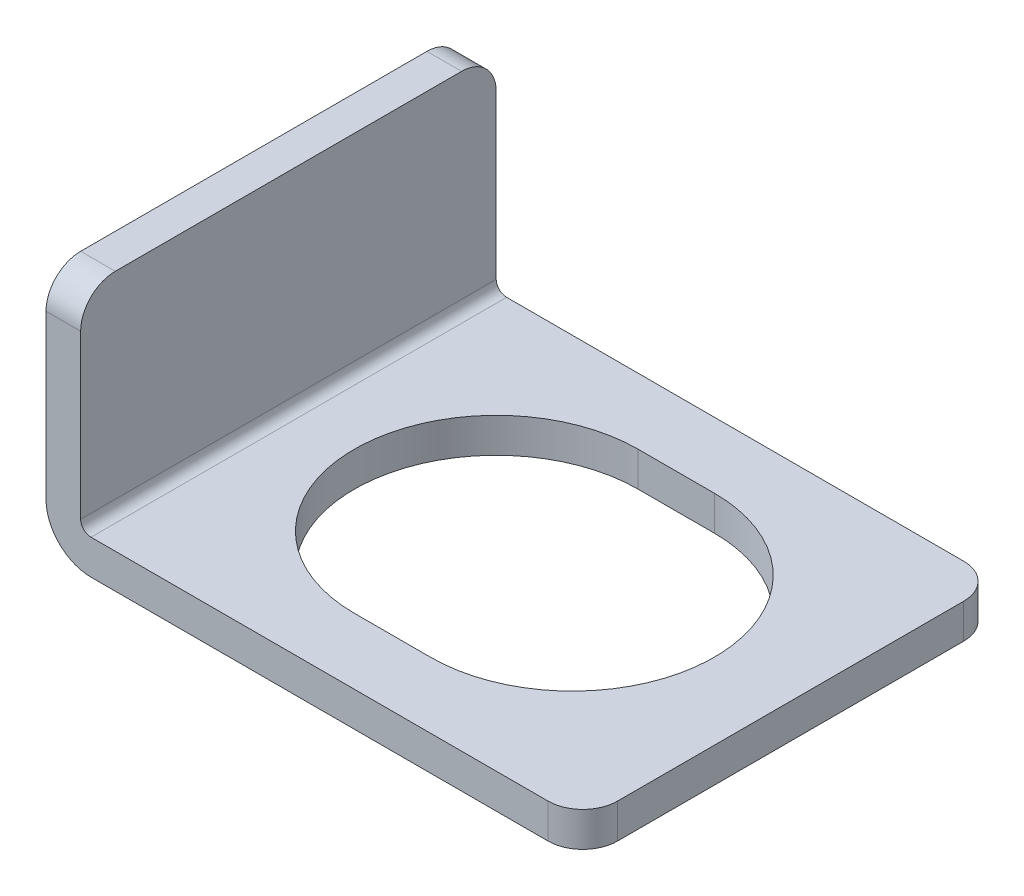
ISO-10303-21;
HEADER;
FILE_DESCRIPTION(('STEP AP214'),'2;1');
FILE_NAME('part.step','',(''),(''),'','','');
FILE_SCHEMA(('AUTOMOTIVE_DESIGN { 1 0 10303 214 1 1 1 1 }'));
ENDSEC;
DATA;
#1=APPLICATION_CONTEXT('core data for automotive mechanical design processes');
#2=APPLICATION_PROTOCOL_DEFINITION('international standard','automotive_design',2000,#1);
#3=PRODUCT_CONTEXT('',#1,'mechanical');
#4=PRODUCT('Part','Part','',(#3));
#5=PRODUCT_RELATED_PRODUCT_CATEGORY('part','',(#4));
#6=PRODUCT_DEFINITION_FORMATION('','',#4);
#7=PRODUCT_DEFINITION_CONTEXT('part definition',#1,'design');
#8=PRODUCT_DEFINITION('design','',#6,#7);
#9=PRODUCT_DEFINITION_SHAPE('','',#8);
#10=(LENGTH_UNIT() NAMED_UNIT(*) SI_UNIT(.MILLI.,.METRE.));
#11=(NAMED_UNIT(*) PLANE_ANGLE_UNIT() SI_UNIT($,.RADIAN.));
#12=(NAMED_UNIT(*) SI_UNIT($,.STERADIAN.) SOLID_ANGLE_UNIT());
#13=UNCERTAINTY_MEASURE_WITH_UNIT(LENGTH_MEASURE(1.E-05),#10,'distance_accuracy_value','');
#14=(GEOMETRIC_REPRESENTATION_CONTEXT(3) GLOBAL_UNCERTAINTY_ASSIGNED_CONTEXT((#13)) GLOBAL_UNIT_ASSIGNED_CONTEXT((#10,
#11,#12)) REPRESENTATION_CONTEXT('',''));
#15=CARTESIAN_POINT('',(0.,0.,0.));
#16=DIRECTION('',(0.,0.,1.));
#17=DIRECTION('',(1.,0.,0.));
#18=AXIS2_PLACEMENT_3D('',#15,#16,#17);
#19=CARTESIAN_POINT('',(-6.,0.3,6.));
#20=DIRECTION('',(-1.,0.,0.));
#21=DIRECTION('',(0.,-1.,0.));
#22=AXIS2_PLACEMENT_3D('',#19,#20,#21);
#23=PLANE('',#22);
#24=DIRECTION('',(0.,1.,0.));
#25=VECTOR('',#24,1.);
#26=CARTESIAN_POINT('',(-6.,0.3,-6.));
#27=LINE('',#26,#25);
#28=CARTESIAN_POINT('',(-6.,0.3,-6.));
#29=VERTEX_POINT('',#28);
#30=CARTESIAN_POINT('',(-6.,5.,-6.));
#31=VERTEX_POINT('',#30);
#32=EDGE_CURVE('E167',#29,#31,#27,.T.);
#33=ORIENTED_EDGE('',*,*,#32,.T.);
#34=CARTESIAN_POINT('',(-6.,5.,-5.));
#35=DIRECTION('',(-1.,0.,0.));
#36=DIRECTION('',(0.,-1.,0.));
#37=AXIS2_PLACEMENT_3D('',#34,#35,#36);
#38=CIRCLE('',#37,1.);
#39=CARTESIAN_POINT('',(-6.,6.,-5.));
#40=VERTEX_POINT('',#39);
#41=EDGE_CURVE('E245',#31,#40,#38,.F.);
#42=ORIENTED_EDGE('',*,*,#41,.T.);
#43=DIRECTION('',(0.,0.,-1.));
#44=VECTOR('',#43,1.);
#45=CARTESIAN_POINT('',(-6.,6.,6.));
#46=LINE('',#45,#44);
#47=CARTESIAN_POINT('',(-6.,6.,5.));
#48=VERTEX_POINT('',#47);
#49=EDGE_CURVE('E218',#48,#40,#46,.T.);
#50=ORIENTED_EDGE('',*,*,#49,.F.);
#51=CARTESIAN_POINT('',(-6.,5.,5.));
#52=DIRECTION('',(-1.,0.,0.));
#53=DIRECTION('',(0.,-1.,0.));
#54=AXIS2_PLACEMENT_3D('',#51,#52,#53);
#55=CIRCLE('',#54,1.);
#56=CARTESIAN_POINT('',(-6.,5.,6.));
#57=VERTEX_POINT('',#56);
#58=EDGE_CURVE('E243',#48,#57,#55,.F.);
#59=ORIENTED_EDGE('',*,*,#58,.T.);
#60=DIRECTION('',(0.,1.,0.));
#61=VECTOR('',#60,1.);
#62=CARTESIAN_POINT('',(-6.,0.3,6.));
#63=LINE('',#62,#61);
#64=CARTESIAN_POINT('',(-6.,0.3,6.));
#65=VERTEX_POINT('',#64);
#66=EDGE_CURVE('E171',#65,#57,#63,.T.);
#67=ORIENTED_EDGE('',*,*,#66,.F.);
#68=DIRECTION('',(0.,0.,-1.));
#69=VECTOR('',#68,1.);
#70=CARTESIAN_POINT('',(-6.,0.3,6.));
#71=LINE('',#70,#69);
#72=EDGE_CURVE('E186',#65,#29,#71,.T.);
#73=ORIENTED_EDGE('',*,*,#72,.T.);
#74=EDGE_LOOP('',(#33,#42,#50,#59,#67,#73));
#75=FACE_BOUND('',#74,.T.);
#76=ADVANCED_FACE('F14',(#75),#23,.F.);
#77=CARTESIAN_POINT('',(-7.,6.,6.));
#78=DIRECTION('',(0.,1.,0.));
#79=DIRECTION('',(0.,0.,1.));
#80=AXIS2_PLACEMENT_3D('',#77,#78,#79);
#81=PLANE('',#80);
#82=ORIENTED_EDGE('',*,*,#49,.T.);
#83=DIRECTION('',(1.,0.,0.));
#84=VECTOR('',#83,1.);
#85=CARTESIAN_POINT('',(-7.,6.,-5.));
#86=LINE('',#85,#84);
#87=CARTESIAN_POINT('',(-7.,6.,-5.));
#88=VERTEX_POINT('',#87);
#89=EDGE_CURVE('E29',#40,#88,#86,.F.);
#90=ORIENTED_EDGE('',*,*,#89,.T.);
#91=DIRECTION('',(0.,0.,-1.));
#92=VECTOR('',#91,1.);
#93=CARTESIAN_POINT('',(-7.,6.,6.));
#94=LINE('',#93,#92);
#95=CARTESIAN_POINT('',(-7.,6.,5.));
#96=VERTEX_POINT('',#95);
#97=EDGE_CURVE('E216',#96,#88,#94,.T.);
#98=ORIENTED_EDGE('',*,*,#97,.F.);
#99=DIRECTION('',(1.,0.,0.));
#100=VECTOR('',#99,1.);
#101=CARTESIAN_POINT('',(-7.,6.,5.));
#102=LINE('',#101,#100);
#103=EDGE_CURVE('E247',#96,#48,#102,.T.);
#104=ORIENTED_EDGE('',*,*,#103,.T.);
#105=EDGE_LOOP('',(#82,#90,#98,#104));
#106=FACE_BOUND('',#105,.T.);
#107=ADVANCED_FACE('F252',(#106),#81,.T.);
#108=CARTESIAN_POINT('',(-7.,0.3,6.));
#109=DIRECTION('',(-1.,0.,0.));
#110=DIRECTION('',(0.,-1.,0.));
#111=AXIS2_PLACEMENT_3D('',#108,#109,#110);
#112=PLANE('',#111);
#113=ORIENTED_EDGE('',*,*,#97,.T.);
#114=CARTESIAN_POINT('',(-7.,5.,-5.));
#115=DIRECTION('',(-1.,0.,0.));
#116=DIRECTION('',(0.,-1.,0.));
#117=AXIS2_PLACEMENT_3D('',#114,#115,#116);
#118=CIRCLE('',#117,1.);
#119=CARTESIAN_POINT('',(-7.,5.,-6.));
#120=VERTEX_POINT('',#119);
#121=EDGE_CURVE('E9',#88,#120,#118,.T.);
#122=ORIENTED_EDGE('',*,*,#121,.T.);
#123=DIRECTION('',(0.,1.,0.));
#124=VECTOR('',#123,1.);
#125=CARTESIAN_POINT('',(-7.,0.3,-6.));
#126=LINE('',#125,#124);
#127=CARTESIAN_POINT('',(-7.,0.3,-6.));
#128=VERTEX_POINT('',#127);
#129=EDGE_CURVE('E189',#128,#120,#126,.T.);
#130=ORIENTED_EDGE('',*,*,#129,.F.);
#131=DIRECTION('',(0.,0.,-1.));
#132=VECTOR('',#131,1.);
#133=CARTESIAN_POINT('',(-7.,0.3,6.));
#134=LINE('',#133,#132);
#135=CARTESIAN_POINT('',(-7.,0.3,6.));
#136=VERTEX_POINT('',#135);
#137=EDGE_CURVE('E214',#136,#128,#134,.T.);
#138=ORIENTED_EDGE('',*,*,#137,.F.);
#139=DIRECTION('',(0.,1.,0.));
#140=VECTOR('',#139,1.);
#141=CARTESIAN_POINT('',(-7.,0.3,6.));
#142=LINE('',#141,#140);
#143=CARTESIAN_POINT('',(-7.,5.,6.));
#144=VERTEX_POINT('',#143);
#145=EDGE_CURVE('E174',#136,#144,#142,.T.);
#146=ORIENTED_EDGE('',*,*,#145,.T.);
#147=CARTESIAN_POINT('',(-7.,5.,5.));
#148=DIRECTION('',(-1.,0.,0.));
#149=DIRECTION('',(0.,-1.,0.));
#150=AXIS2_PLACEMENT_3D('',#147,#148,#149);
#151=CIRCLE('',#150,1.);
#152=EDGE_CURVE('E22',#144,#96,#151,.T.);
#153=ORIENTED_EDGE('',*,*,#152,.T.);
#154=EDGE_LOOP('',(#113,#122,#130,#138,#146,#153));
#155=FACE_BOUND('',#154,.T.);
#156=ADVANCED_FACE('F267',(#155),#112,.T.);
#157=CARTESIAN_POINT('',(-5.7,0.3,6.));
#158=DIRECTION('',(0.,0.,-1.));
#159=DIRECTION('',(-1.,0.,0.));
#160=AXIS2_PLACEMENT_3D('',#157,#158,#159);
#161=CYLINDRICAL_SURFACE('',#160,1.3);
#162=CARTESIAN_POINT('',(-5.7,0.3,-6.));
#163=DIRECTION('',(0.,0.,1.));
#164=DIRECTION('',(1.,0.,0.));
#165=AXIS2_PLACEMENT_3D('',#162,#163,#164);
#166=CIRCLE('',#165,1.3);
#167=CARTESIAN_POINT('',(-5.7,-1.,-6.));
#168=VERTEX_POINT('',#167);
#169=EDGE_CURVE('E192',#168,#128,#166,.F.);
#170=ORIENTED_EDGE('',*,*,#169,.F.);
#171=DIRECTION('',(0.,0.,-1.));
#172=VECTOR('',#171,1.);
#173=CARTESIAN_POINT('',(-5.7,-1.,6.));
#174=LINE('',#173,#172);
#175=CARTESIAN_POINT('',(-5.7,-1.,6.));
#176=VERTEX_POINT('',#175);
#177=EDGE_CURVE('E211',#176,#168,#174,.T.);
#178=ORIENTED_EDGE('',*,*,#177,.F.);
#179=CARTESIAN_POINT('',(-5.7,0.3,6.));
#180=DIRECTION('',(0.,0.,1.));
#181=DIRECTION('',(1.,0.,0.));
#182=AXIS2_PLACEMENT_3D('',#179,#180,#181);
#183=CIRCLE('',#182,1.3);
#184=EDGE_CURVE('E177',#176,#136,#183,.F.);
#185=ORIENTED_EDGE('',*,*,#184,.T.);
#186=ORIENTED_EDGE('',*,*,#137,.T.);
#187=EDGE_LOOP('',(#170,#178,#185,#186));
#188=FACE_BOUND('',#187,.T.);
#189=ADVANCED_FACE('F276',(#188),#161,.T.);
#190=CARTESIAN_POINT('',(0.,-1.,6.));
#191=DIRECTION('',(0.,-1.,0.));
#192=DIRECTION('',(0.,0.,-1.));
#193=AXIS2_PLACEMENT_3D('',#190,#191,#192);
#194=PLANE('',#193);
#195=CARTESIAN_POINT('',(0.,-1.,0.));
#196=DIRECTION('',(0.,1.,0.));
#197=DIRECTION('',(-1.,0.,0.));
#198=AXIS2_PLACEMENT_3D('',#195,#196,#197);
#199=CIRCLE('',#198,4.1);
#200=CARTESIAN_POINT('',(0.,-1.,-4.1));
#201=VERTEX_POINT('',#200);
#202=CARTESIAN_POINT('',(0.,-1.,4.1));
#203=VERTEX_POINT('',#202);
#204=EDGE_CURVE('E131',#201,#203,#199,.T.);
#205=ORIENTED_EDGE('',*,*,#204,.T.);
#206=DIRECTION('',(1.,0.,0.));
#207=VECTOR('',#206,1.);
#208=CARTESIAN_POINT('',(0.,-1.,4.1));
#209=LINE('',#208,#207);
#210=CARTESIAN_POINT('',(2.2,-1.,4.1));
#211=VERTEX_POINT('',#210);
#212=EDGE_CURVE('E143',#203,#211,#209,.T.);
#213=ORIENTED_EDGE('',*,*,#212,.T.);
#214=CARTESIAN_POINT('',(2.2,-1.,0.));
#215=DIRECTION('',(0.,1.,0.));
#216=DIRECTION('',(1.,0.,0.));
#217=AXIS2_PLACEMENT_3D('',#214,#215,#216);
#218=CIRCLE('',#217,4.1);
#219=CARTESIAN_POINT('',(2.2,-1.,-4.1));
#220=VERTEX_POINT('',#219);
#221=EDGE_CURVE('E147',#211,#220,#218,.T.);
#222=ORIENTED_EDGE('',*,*,#221,.T.);
#223=DIRECTION('',(-1.,0.,0.));
#224=VECTOR('',#223,1.);
#225=CARTESIAN_POINT('',(0.,-1.,-4.1));
#226=LINE('',#225,#224);
#227=EDGE_CURVE('E139',#220,#201,#226,.T.);
#228=ORIENTED_EDGE('',*,*,#227,.T.);
#229=EDGE_LOOP('',(#205,#213,#222,#228));
#230=FACE_BOUND('',#229,.T.);
#231=DIRECTION('',(1.,0.,0.));
#232=VECTOR('',#231,1.);
#233=CARTESIAN_POINT('',(0.,-1.,-6.));
#234=LINE('',#233,#232);
#235=CARTESIAN_POINT('',(7.5,-1.,-6.));
#236=VERTEX_POINT('',#235);
#237=EDGE_CURVE('E195',#236,#168,#234,.F.);
#238=ORIENTED_EDGE('',*,*,#237,.F.);
#239=CARTESIAN_POINT('',(7.5,-1.,-5.));
#240=DIRECTION('',(0.,-1.,0.));
#241=DIRECTION('',(0.,0.,-1.));
#242=AXIS2_PLACEMENT_3D('',#239,#240,#241);
#243=CIRCLE('',#242,1.);
#244=CARTESIAN_POINT('',(8.5,-1.,-5.));
#245=VERTEX_POINT('',#244);
#246=EDGE_CURVE('E228',#236,#245,#243,.T.);
#247=ORIENTED_EDGE('',*,*,#246,.T.);
#248=DIRECTION('',(0.,0.,-1.));
#249=VECTOR('',#248,1.);
#250=CARTESIAN_POINT('',(8.5,-1.,6.));
#251=LINE('',#250,#249);
#252=CARTESIAN_POINT('',(8.5,-1.,5.));
#253=VERTEX_POINT('',#252);
#254=EDGE_CURVE('E208',#253,#245,#251,.T.);
#255=ORIENTED_EDGE('',*,*,#254,.F.);
#256=CARTESIAN_POINT('',(7.5,-1.,5.));
#257=DIRECTION('',(0.,-1.,0.));
#258=DIRECTION('',(0.,0.,-1.));
#259=AXIS2_PLACEMENT_3D('',#256,#257,#258);
#260=CIRCLE('',#259,1.);
#261=CARTESIAN_POINT('',(7.5,-1.,6.));
#262=VERTEX_POINT('',#261);
#263=EDGE_CURVE('E226',#253,#262,#260,.T.);
#264=ORIENTED_EDGE('',*,*,#263,.T.);
#265=DIRECTION('',(-1.,0.,0.));
#266=VECTOR('',#265,1.);
#267=CARTESIAN_POINT('',(0.,-1.,6.));
#268=LINE('',#267,#266);
#269=EDGE_CURVE('E180',#262,#176,#268,.T.);
#270=ORIENTED_EDGE('',*,*,#269,.T.);
#271=ORIENTED_EDGE('',*,*,#177,.T.);
#272=EDGE_LOOP('',(#238,#247,#255,#264,#270,#271));
#273=FACE_BOUND('',#272,.T.);
#274=ADVANCED_FACE('F149',(#230,#273),#194,.T.);
#275=CARTESIAN_POINT('',(8.5,0.,6.));
#276=DIRECTION('',(1.,0.,0.));
#277=DIRECTION('',(0.,0.,-1.));
#278=AXIS2_PLACEMENT_3D('',#275,#276,#277);
#279=PLANE('',#278);
#280=ORIENTED_EDGE('',*,*,#254,.T.);
#281=DIRECTION('',(0.,-1.,0.));
#282=VECTOR('',#281,1.);
#283=CARTESIAN_POINT('',(8.5,0.,-5.));
#284=LINE('',#283,#282);
#285=CARTESIAN_POINT('',(8.5,0.,-5.));
#286=VERTEX_POINT('',#285);
#287=EDGE_CURVE('E233',#245,#286,#284,.F.);
#288=ORIENTED_EDGE('',*,*,#287,.T.);
#289=DIRECTION('',(0.,0.,-1.));
#290=VECTOR('',#289,1.);
#291=CARTESIAN_POINT('',(8.5,0.,6.));
#292=LINE('',#291,#290);
#293=CARTESIAN_POINT('',(8.5,0.,5.));
#294=VERTEX_POINT('',#293);
#295=EDGE_CURVE('E205',#294,#286,#292,.T.);
#296=ORIENTED_EDGE('',*,*,#295,.F.);
#297=DIRECTION('',(0.,-1.,0.));
#298=VECTOR('',#297,1.);
#299=CARTESIAN_POINT('',(8.5,0.,5.));
#300=LINE('',#299,#298);
#301=EDGE_CURVE('E230',#294,#253,#300,.T.);
#302=ORIENTED_EDGE('',*,*,#301,.T.);
#303=EDGE_LOOP('',(#280,#288,#296,#302));
#304=FACE_BOUND('',#303,.T.);
#305=ADVANCED_FACE('F291',(#304),#279,.T.);
#306=CARTESIAN_POINT('',(0.,0.,6.));
#307=DIRECTION('',(0.,-1.,0.));
#308=DIRECTION('',(1.,0.,0.));
#309=AXIS2_PLACEMENT_3D('',#306,#307,#308);
#310=PLANE('',#309);
#311=DIRECTION('',(1.,0.,0.));
#312=VECTOR('',#311,1.);
#313=CARTESIAN_POINT('',(0.,0.,4.1));
#314=LINE('',#313,#312);
#315=CARTESIAN_POINT('',(0.,0.,4.1));
#316=VERTEX_POINT('',#315);
#317=CARTESIAN_POINT('',(2.2,0.,4.1));
#318=VERTEX_POINT('',#317);
#319=EDGE_CURVE('E161',#316,#318,#314,.T.);
#320=ORIENTED_EDGE('',*,*,#319,.F.);
#321=CARTESIAN_POINT('',(0.,0.,0.));
#322=DIRECTION('',(0.,1.,0.));
#323=DIRECTION('',(-1.,0.,0.));
#324=AXIS2_PLACEMENT_3D('',#321,#322,#323);
#325=CIRCLE('',#324,4.1);
#326=CARTESIAN_POINT('',(0.,0.,-4.1));
#327=VERTEX_POINT('',#326);
#328=EDGE_CURVE('E134',#327,#316,#325,.T.);
#329=ORIENTED_EDGE('',*,*,#328,.F.);
#330=DIRECTION('',(-1.,0.,0.));
#331=VECTOR('',#330,1.);
#332=CARTESIAN_POINT('',(0.,0.,-4.1));
#333=LINE('',#332,#331);
#334=CARTESIAN_POINT('',(2.2,0.,-4.1));
#335=VERTEX_POINT('',#334);
#336=EDGE_CURVE('E152',#335,#327,#333,.T.);
#337=ORIENTED_EDGE('',*,*,#336,.F.);
#338=CARTESIAN_POINT('',(2.2,0.,0.));
#339=DIRECTION('',(0.,1.,0.));
#340=DIRECTION('',(1.,0.,0.));
#341=AXIS2_PLACEMENT_3D('',#338,#339,#340);
#342=CIRCLE('',#341,4.1);
#343=EDGE_CURVE('E155',#318,#335,#342,.T.);
#344=ORIENTED_EDGE('',*,*,#343,.F.);
#345=EDGE_LOOP('',(#320,#329,#337,#344));
#346=FACE_BOUND('',#345,.T.);
#347=ORIENTED_EDGE('',*,*,#295,.T.);
#348=CARTESIAN_POINT('',(7.5,0.,-5.));
#349=DIRECTION('',(0.,-1.,0.));
#350=DIRECTION('',(1.,0.,0.));
#351=AXIS2_PLACEMENT_3D('',#348,#349,#350);
#352=CIRCLE('',#351,1.);
#353=CARTESIAN_POINT('',(7.5,0.,-6.));
#354=VERTEX_POINT('',#353);
#355=EDGE_CURVE('E237',#286,#354,#352,.F.);
#356=ORIENTED_EDGE('',*,*,#355,.T.);
#357=DIRECTION('',(-1.,0.,0.));
#358=VECTOR('',#357,1.);
#359=CARTESIAN_POINT('',(0.,0.,-6.));
#360=LINE('',#359,#358);
#361=CARTESIAN_POINT('',(-5.7,0.,-6.));
#362=VERTEX_POINT('',#361);
#363=EDGE_CURVE('E197',#354,#362,#360,.T.);
#364=ORIENTED_EDGE('',*,*,#363,.T.);
#365=DIRECTION('',(0.,0.,-1.));
#366=VECTOR('',#365,1.);
#367=CARTESIAN_POINT('',(-5.7,0.,6.));
#368=LINE('',#367,#366);
#369=CARTESIAN_POINT('',(-5.7,0.,6.));
#370=VERTEX_POINT('',#369);
#371=EDGE_CURVE('E202',#370,#362,#368,.T.);
#372=ORIENTED_EDGE('',*,*,#371,.F.);
#373=DIRECTION('',(-1.,0.,0.));
#374=VECTOR('',#373,1.);
#375=CARTESIAN_POINT('',(0.,0.,6.));
#376=LINE('',#375,#374);
#377=CARTESIAN_POINT('',(7.5,0.,6.));
#378=VERTEX_POINT('',#377);
#379=EDGE_CURVE('E182',#378,#370,#376,.T.);
#380=ORIENTED_EDGE('',*,*,#379,.F.);
#381=CARTESIAN_POINT('',(7.5,0.,5.));
#382=DIRECTION('',(0.,-1.,0.));
#383=DIRECTION('',(1.,0.,0.));
#384=AXIS2_PLACEMENT_3D('',#381,#382,#383);
#385=CIRCLE('',#384,1.);
#386=EDGE_CURVE('E235',#378,#294,#385,.F.);
#387=ORIENTED_EDGE('',*,*,#386,.T.);
#388=EDGE_LOOP('',(#347,#356,#364,#372,#380,#387));
#389=FACE_BOUND('',#388,.T.);
#390=ADVANCED_FACE('F287',(#346,#389),#310,.F.);
#391=CARTESIAN_POINT('',(-5.7,0.3,6.));
#392=DIRECTION('',(0.,0.,-1.));
#393=DIRECTION('',(-1.,0.,0.));
#394=AXIS2_PLACEMENT_3D('',#391,#392,#393);
#395=CYLINDRICAL_SURFACE('',#394,0.3);
#396=CARTESIAN_POINT('',(-5.7,0.3,-6.));
#397=DIRECTION('',(0.,0.,-1.));
#398=DIRECTION('',(-1.,0.,0.));
#399=AXIS2_PLACEMENT_3D('',#396,#397,#398);
#400=CIRCLE('',#399,0.3);
#401=EDGE_CURVE('E175',#362,#29,#400,.T.);
#402=ORIENTED_EDGE('',*,*,#401,.T.);
#403=ORIENTED_EDGE('',*,*,#72,.F.);
#404=CARTESIAN_POINT('',(-5.7,0.3,6.));
#405=DIRECTION('',(0.,0.,-1.));
#406=DIRECTION('',(-1.,0.,0.));
#407=AXIS2_PLACEMENT_3D('',#404,#405,#406);
#408=CIRCLE('',#407,0.3);
#409=EDGE_CURVE('E184',#370,#65,#408,.T.);
#410=ORIENTED_EDGE('',*,*,#409,.F.);
#411=ORIENTED_EDGE('',*,*,#371,.T.);
#412=EDGE_LOOP('',(#402,#403,#410,#411));
#413=FACE_BOUND('',#412,.T.);
#414=ADVANCED_FACE('F298',(#413),#395,.F.);
#415=CARTESIAN_POINT('',(-5.7,0.3,6.));
#416=DIRECTION('',(0.,0.,1.));
#417=DIRECTION('',(1.,0.,0.));
#418=AXIS2_PLACEMENT_3D('',#415,#416,#417);
#419=PLANE('',#418);
#420=ORIENTED_EDGE('',*,*,#269,.F.);
#421=DIRECTION('',(0.,-1.,0.));
#422=VECTOR('',#421,1.);
#423=CARTESIAN_POINT('',(7.5,0.3,6.));
#424=LINE('',#423,#422);
#425=EDGE_CURVE('E241',#262,#378,#424,.F.);
#426=ORIENTED_EDGE('',*,*,#425,.T.);
#427=ORIENTED_EDGE('',*,*,#379,.T.);
#428=ORIENTED_EDGE('',*,*,#409,.T.);
#429=ORIENTED_EDGE('',*,*,#66,.T.);
#430=DIRECTION('',(1.,0.,0.));
#431=VECTOR('',#430,1.);
#432=CARTESIAN_POINT('',(-5.7,5.,6.));
#433=LINE('',#432,#431);
#434=EDGE_CURVE('E239',#57,#144,#433,.F.);
#435=ORIENTED_EDGE('',*,*,#434,.T.);
#436=ORIENTED_EDGE('',*,*,#145,.F.);
#437=ORIENTED_EDGE('',*,*,#184,.F.);
#438=EDGE_LOOP('',(#420,#426,#427,#428,#429,#435,#436,#437));
#439=FACE_BOUND('',#438,.T.);
#440=ADVANCED_FACE('F273',(#439),#419,.T.);
#441=CARTESIAN_POINT('',(-5.7,0.3,-6.));
#442=DIRECTION('',(0.,0.,1.));
#443=DIRECTION('',(1.,0.,0.));
#444=AXIS2_PLACEMENT_3D('',#441,#442,#443);
#445=PLANE('',#444);
#446=ORIENTED_EDGE('',*,*,#363,.F.);
#447=DIRECTION('',(0.,-1.,0.));
#448=VECTOR('',#447,1.);
#449=CARTESIAN_POINT('',(7.5,-1.,-6.));
#450=LINE('',#449,#448);
#451=EDGE_CURVE('E223',#354,#236,#450,.T.);
#452=ORIENTED_EDGE('',*,*,#451,.T.);
#453=ORIENTED_EDGE('',*,*,#237,.T.);
#454=ORIENTED_EDGE('',*,*,#169,.T.);
#455=ORIENTED_EDGE('',*,*,#129,.T.);
#456=DIRECTION('',(1.,0.,0.));
#457=VECTOR('',#456,1.);
#458=CARTESIAN_POINT('',(-6.,5.,-6.));
#459=LINE('',#458,#457);
#460=EDGE_CURVE('E220',#120,#31,#459,.T.);
#461=ORIENTED_EDGE('',*,*,#460,.T.);
#462=ORIENTED_EDGE('',*,*,#32,.F.);
#463=ORIENTED_EDGE('',*,*,#401,.F.);
#464=EDGE_LOOP('',(#446,#452,#453,#454,#455,#461,#462,#463));
#465=FACE_BOUND('',#464,.T.);
#466=ADVANCED_FACE('F263',(#465),#445,.F.);
#467=CARTESIAN_POINT('',(0.,-1.,0.));
#468=DIRECTION('',(0.,1.,0.));
#469=DIRECTION('',(-1.,0.,0.));
#470=AXIS2_PLACEMENT_3D('',#467,#468,#469);
#471=CYLINDRICAL_SURFACE('',#470,4.1);
#472=ORIENTED_EDGE('',*,*,#328,.T.);
#473=DIRECTION('',(0.,1.,0.));
#474=VECTOR('',#473,1.);
#475=CARTESIAN_POINT('',(0.,-1.,4.1));
#476=LINE('',#475,#474);
#477=EDGE_CURVE('E127',#203,#316,#476,.T.);
#478=ORIENTED_EDGE('',*,*,#477,.F.);
#479=ORIENTED_EDGE('',*,*,#204,.F.);
#480=DIRECTION('',(0.,1.,0.));
#481=VECTOR('',#480,1.);
#482=CARTESIAN_POINT('',(0.,-1.,-4.1));
#483=LINE('',#482,#481);
#484=EDGE_CURVE('E165',#201,#327,#483,.T.);
#485=ORIENTED_EDGE('',*,*,#484,.T.);
#486=EDGE_LOOP('',(#472,#478,#479,#485));
#487=FACE_BOUND('',#486,.T.);
#488=ADVANCED_FACE('F129',(#487),#471,.F.);
#489=CARTESIAN_POINT('',(0.,-1.,-4.1));
#490=DIRECTION('',(0.,0.,-1.));
#491=DIRECTION('',(-1.,0.,0.));
#492=AXIS2_PLACEMENT_3D('',#489,#490,#491);
#493=PLANE('',#492);
#494=ORIENTED_EDGE('',*,*,#336,.T.);
#495=ORIENTED_EDGE('',*,*,#484,.F.);
#496=ORIENTED_EDGE('',*,*,#227,.F.);
#497=DIRECTION('',(0.,1.,0.));
#498=VECTOR('',#497,1.);
#499=CARTESIAN_POINT('',(2.2,-1.,-4.1));
#500=LINE('',#499,#498);
#501=EDGE_CURVE('E168',#220,#335,#500,.T.);
#502=ORIENTED_EDGE('',*,*,#501,.T.);
#503=EDGE_LOOP('',(#494,#495,#496,#502));
#504=FACE_BOUND('',#503,.T.);
#505=ADVANCED_FACE('F368',(#504),#493,.F.);
#506=CARTESIAN_POINT('',(2.2,-1.,0.));
#507=DIRECTION('',(0.,1.,0.));
#508=DIRECTION('',(-1.,0.,0.));
#509=AXIS2_PLACEMENT_3D('',#506,#507,#508);
#510=CYLINDRICAL_SURFACE('',#509,4.1);
#511=ORIENTED_EDGE('',*,*,#343,.T.);
#512=ORIENTED_EDGE('',*,*,#501,.F.);
#513=ORIENTED_EDGE('',*,*,#221,.F.);
#514=DIRECTION('',(0.,1.,0.));
#515=VECTOR('',#514,1.);
#516=CARTESIAN_POINT('',(2.2,-1.,4.1));
#517=LINE('',#516,#515);
#518=EDGE_CURVE('E138',#211,#318,#517,.T.);
#519=ORIENTED_EDGE('',*,*,#518,.T.);
#520=EDGE_LOOP('',(#511,#512,#513,#519));
#521=FACE_BOUND('',#520,.T.);
#522=ADVANCED_FACE('F361',(#521),#510,.F.);
#523=CARTESIAN_POINT('',(0.,-1.,4.1));
#524=DIRECTION('',(0.,0.,1.));
#525=DIRECTION('',(1.,0.,0.));
#526=AXIS2_PLACEMENT_3D('',#523,#524,#525);
#527=PLANE('',#526);
#528=ORIENTED_EDGE('',*,*,#319,.T.);
#529=ORIENTED_EDGE('',*,*,#518,.F.);
#530=ORIENTED_EDGE('',*,*,#212,.F.);
#531=ORIENTED_EDGE('',*,*,#477,.T.);
#532=EDGE_LOOP('',(#528,#529,#530,#531));
#533=FACE_BOUND('',#532,.T.);
#534=ADVANCED_FACE('F144',(#533),#527,.F.);
#535=CARTESIAN_POINT('',(7.5,0.3,-5.));
#536=DIRECTION('',(0.,1.,0.));
#537=DIRECTION('',(0.,0.,1.));
#538=AXIS2_PLACEMENT_3D('',#535,#536,#537);
#539=CYLINDRICAL_SURFACE('',#538,1.);
#540=ORIENTED_EDGE('',*,*,#355,.F.);
#541=ORIENTED_EDGE('',*,*,#287,.F.);
#542=ORIENTED_EDGE('',*,*,#246,.F.);
#543=ORIENTED_EDGE('',*,*,#451,.F.);
#544=EDGE_LOOP('',(#540,#541,#542,#543));
#545=FACE_BOUND('',#544,.T.);
#546=ADVANCED_FACE('F294',(#545),#539,.T.);
#547=CARTESIAN_POINT('',(7.5,0.,5.));
#548=DIRECTION('',(0.,-1.,0.));
#549=DIRECTION('',(0.,0.,-1.));
#550=AXIS2_PLACEMENT_3D('',#547,#548,#549);
#551=CYLINDRICAL_SURFACE('',#550,1.);
#552=ORIENTED_EDGE('',*,*,#386,.F.);
#553=ORIENTED_EDGE('',*,*,#425,.F.);
#554=ORIENTED_EDGE('',*,*,#263,.F.);
#555=ORIENTED_EDGE('',*,*,#301,.F.);
#556=EDGE_LOOP('',(#552,#553,#554,#555));
#557=FACE_BOUND('',#556,.T.);
#558=ADVANCED_FACE('F283',(#557),#551,.T.);
#559=CARTESIAN_POINT('',(-5.7,5.,-5.));
#560=DIRECTION('',(-1.,0.,0.));
#561=DIRECTION('',(0.,0.,1.));
#562=AXIS2_PLACEMENT_3D('',#559,#560,#561);
#563=CYLINDRICAL_SURFACE('',#562,1.);
#564=ORIENTED_EDGE('',*,*,#121,.F.);
#565=ORIENTED_EDGE('',*,*,#89,.F.);
#566=ORIENTED_EDGE('',*,*,#41,.F.);
#567=ORIENTED_EDGE('',*,*,#460,.F.);
#568=EDGE_LOOP('',(#564,#565,#566,#567));
#569=FACE_BOUND('',#568,.T.);
#570=ADVANCED_FACE('F260',(#569),#563,.T.);
#571=CARTESIAN_POINT('',(-7.,5.,5.));
#572=DIRECTION('',(1.,0.,0.));
#573=DIRECTION('',(0.,0.,-1.));
#574=AXIS2_PLACEMENT_3D('',#571,#572,#573);
#575=CYLINDRICAL_SURFACE('',#574,1.);
#576=ORIENTED_EDGE('',*,*,#152,.F.);
#577=ORIENTED_EDGE('',*,*,#434,.F.);
#578=ORIENTED_EDGE('',*,*,#58,.F.);
#579=ORIENTED_EDGE('',*,*,#103,.F.);
#580=EDGE_LOOP('',(#576,#577,#578,#579));
#581=FACE_BOUND('',#580,.T.);
#582=ADVANCED_FACE('F16',(#581),#575,.T.);
#583=CLOSED_SHELL('',(#76,#107,#156,#189,#274,#305,#390,#414,#440,#466,#488,#505,#522,#534,#546,
#558,#570,#582));
#584=MANIFOLD_SOLID_BREP('B1',#583);
#585=ADVANCED_BREP_SHAPE_REPRESENTATION('',(#18,#584),#14);
#586=SHAPE_DEFINITION_REPRESENTATION(#9,#585);
ENDSEC;
END-ISO-10303-21;
